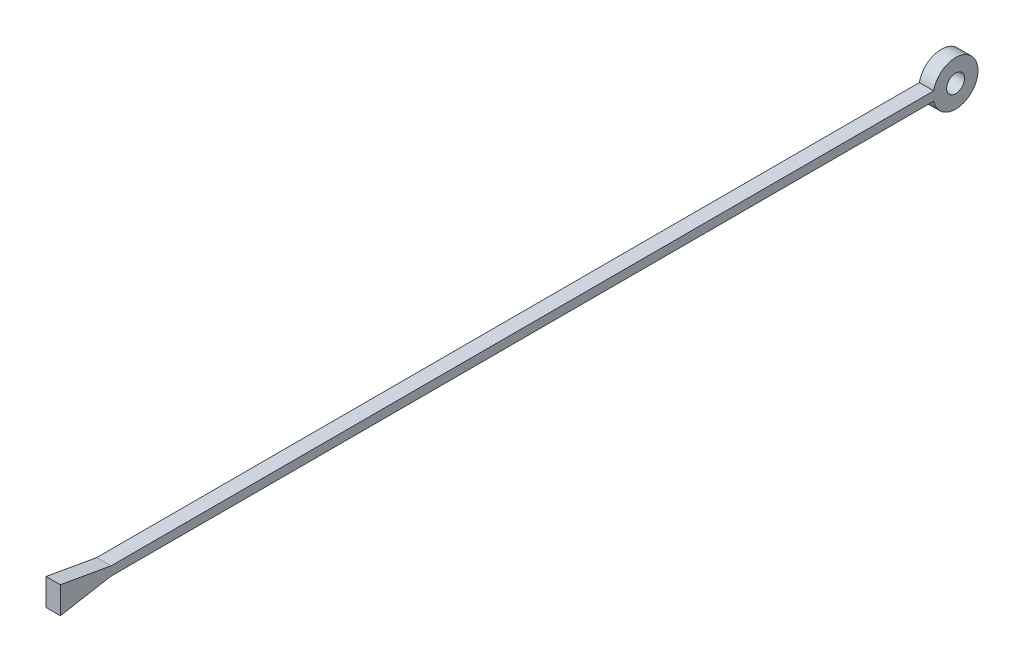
ISO-10303-21;
HEADER;
FILE_DESCRIPTION(('STEP AP214'),'2;1');
FILE_NAME('part.step','',(''),(''),'','','');
FILE_SCHEMA(('AUTOMOTIVE_DESIGN { 1 0 10303 214 1 1 1 1 }'));
ENDSEC;
DATA;
#1=APPLICATION_CONTEXT('core data for automotive mechanical design processes');
#2=APPLICATION_PROTOCOL_DEFINITION('international standard','automotive_design',2000,#1);
#3=PRODUCT_CONTEXT('',#1,'mechanical');
#4=PRODUCT('Part','Part','',(#3));
#5=PRODUCT_RELATED_PRODUCT_CATEGORY('part','',(#4));
#6=PRODUCT_DEFINITION_FORMATION('','',#4);
#7=PRODUCT_DEFINITION_CONTEXT('part definition',#1,'design');
#8=PRODUCT_DEFINITION('design','',#6,#7);
#9=PRODUCT_DEFINITION_SHAPE('','',#8);
#10=(LENGTH_UNIT() NAMED_UNIT(*) SI_UNIT(.MILLI.,.METRE.));
#11=(NAMED_UNIT(*) PLANE_ANGLE_UNIT() SI_UNIT($,.RADIAN.));
#12=(NAMED_UNIT(*) SI_UNIT($,.STERADIAN.) SOLID_ANGLE_UNIT());
#13=UNCERTAINTY_MEASURE_WITH_UNIT(LENGTH_MEASURE(1.E-05),#10,'distance_accuracy_value','');
#14=(GEOMETRIC_REPRESENTATION_CONTEXT(3) GLOBAL_UNCERTAINTY_ASSIGNED_CONTEXT((#13)) GLOBAL_UNIT_ASSIGNED_CONTEXT((#10,
#11,#12)) REPRESENTATION_CONTEXT('',''));
#15=CARTESIAN_POINT('',(0.,0.,0.));
#16=DIRECTION('',(0.,0.,1.));
#17=DIRECTION('',(1.,0.,0.));
#18=AXIS2_PLACEMENT_3D('',#15,#16,#17);
#19=CARTESIAN_POINT('',(8.,0.,0.));
#20=DIRECTION('',(1.,0.,0.));
#21=DIRECTION('',(0.,0.,-1.));
#22=AXIS2_PLACEMENT_3D('',#19,#20,#21);
#23=PLANE('',#22);
#24=DIRECTION('',(0.,0.173648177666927,0.984807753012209));
#25=VECTOR('',#24,1.);
#26=CARTESIAN_POINT('',(8.,2.5,471.643590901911));
#27=LINE('',#26,#25);
#28=CARTESIAN_POINT('',(8.,2.5,471.643590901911));
#29=VERTEX_POINT('',#28);
#30=CARTESIAN_POINT('',(8.,7.49999999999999,500.));
#31=VERTEX_POINT('',#30);
#32=EDGE_CURVE('E132',#29,#31,#27,.T.);
#33=ORIENTED_EDGE('',*,*,#32,.T.);
#34=DIRECTION('',(0.,-1.,0.));
#35=VECTOR('',#34,1.);
#36=CARTESIAN_POINT('',(8.,7.49999999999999,500.));
#37=LINE('',#36,#35);
#38=CARTESIAN_POINT('',(8.,-7.50000000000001,500.));
#39=VERTEX_POINT('',#38);
#40=EDGE_CURVE('E90',#31,#39,#37,.T.);
#41=ORIENTED_EDGE('',*,*,#40,.T.);
#42=DIRECTION('',(0.,0.173648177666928,-0.984807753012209));
#43=VECTOR('',#42,1.);
#44=CARTESIAN_POINT('',(8.,-2.5,471.643590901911));
#45=LINE('',#44,#43);
#46=CARTESIAN_POINT('',(8.,-2.5,471.643590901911));
#47=VERTEX_POINT('',#46);
#48=EDGE_CURVE('E103',#39,#47,#45,.T.);
#49=ORIENTED_EDGE('',*,*,#48,.T.);
#50=DIRECTION('',(0.,0.,-1.));
#51=VECTOR('',#50,1.);
#52=CARTESIAN_POINT('',(8.,-2.5,471.643590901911));
#53=LINE('',#52,#51);
#54=CARTESIAN_POINT('',(8.,-2.5,12.2474487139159));
#55=VERTEX_POINT('',#54);
#56=EDGE_CURVE('E97',#47,#55,#53,.T.);
#57=ORIENTED_EDGE('',*,*,#56,.T.);
#58=CARTESIAN_POINT('',(8.,0.,0.));
#59=DIRECTION('',(1.,0.,0.));
#60=DIRECTION('',(0.,0.,-1.));
#61=AXIS2_PLACEMENT_3D('',#58,#59,#60);
#62=CIRCLE('',#61,12.5);
#63=CARTESIAN_POINT('',(8.,2.5,12.2474487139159));
#64=VERTEX_POINT('',#63);
#65=EDGE_CURVE('E101',#55,#64,#62,.T.);
#66=ORIENTED_EDGE('',*,*,#65,.T.);
#67=DIRECTION('',(0.,0.,1.));
#68=VECTOR('',#67,1.);
#69=CARTESIAN_POINT('',(8.,2.5,471.643590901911));
#70=LINE('',#69,#68);
#71=EDGE_CURVE('E53',#64,#29,#70,.T.);
#72=ORIENTED_EDGE('',*,*,#71,.T.);
#73=EDGE_LOOP('',(#33,#41,#49,#57,#66,#72));
#74=FACE_BOUND('',#73,.T.);
#75=CARTESIAN_POINT('',(8.,0.,0.));
#76=DIRECTION('',(1.,0.,0.));
#77=DIRECTION('',(0.,0.,-1.));
#78=AXIS2_PLACEMENT_3D('',#75,#76,#77);
#79=CIRCLE('',#78,5.);
#80=CARTESIAN_POINT('',(8.,0.,-5.));
#81=VERTEX_POINT('',#80);
#82=EDGE_CURVE('E125',#81,#81,#79,.T.);
#83=ORIENTED_EDGE('',*,*,#82,.F.);
#84=EDGE_LOOP('',(#83));
#85=FACE_BOUND('',#84,.T.);
#86=ADVANCED_FACE('F36',(#74,#85),#23,.T.);
#87=CARTESIAN_POINT('',(0.,0.,0.));
#88=DIRECTION('',(1.,0.,0.));
#89=DIRECTION('',(0.,0.,-1.));
#90=AXIS2_PLACEMENT_3D('',#87,#88,#89);
#91=PLANE('',#90);
#92=DIRECTION('',(0.,0.173648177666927,0.984807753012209));
#93=VECTOR('',#92,1.);
#94=CARTESIAN_POINT('',(0.,2.5,471.643590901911));
#95=LINE('',#94,#93);
#96=CARTESIAN_POINT('',(0.,2.5,471.643590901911));
#97=VERTEX_POINT('',#96);
#98=CARTESIAN_POINT('',(0.,7.49999999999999,500.));
#99=VERTEX_POINT('',#98);
#100=EDGE_CURVE('E121',#97,#99,#95,.T.);
#101=ORIENTED_EDGE('',*,*,#100,.F.);
#102=DIRECTION('',(0.,0.,1.));
#103=VECTOR('',#102,1.);
#104=CARTESIAN_POINT('',(0.,2.5,471.643590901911));
#105=LINE('',#104,#103);
#106=CARTESIAN_POINT('',(0.,2.5,12.2474487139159));
#107=VERTEX_POINT('',#106);
#108=EDGE_CURVE('E82',#107,#97,#105,.T.);
#109=ORIENTED_EDGE('',*,*,#108,.F.);
#110=CARTESIAN_POINT('',(0.,0.,0.));
#111=DIRECTION('',(1.,0.,0.));
#112=DIRECTION('',(0.,0.,-1.));
#113=AXIS2_PLACEMENT_3D('',#110,#111,#112);
#114=CIRCLE('',#113,12.5);
#115=CARTESIAN_POINT('',(0.,-2.5,12.2474487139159));
#116=VERTEX_POINT('',#115);
#117=EDGE_CURVE('E76',#116,#107,#114,.T.);
#118=ORIENTED_EDGE('',*,*,#117,.F.);
#119=DIRECTION('',(0.,0.,-1.));
#120=VECTOR('',#119,1.);
#121=CARTESIAN_POINT('',(0.,-2.5,471.643590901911));
#122=LINE('',#121,#120);
#123=CARTESIAN_POINT('',(0.,-2.5,471.643590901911));
#124=VERTEX_POINT('',#123);
#125=EDGE_CURVE('E111',#124,#116,#122,.T.);
#126=ORIENTED_EDGE('',*,*,#125,.F.);
#127=DIRECTION('',(0.,0.173648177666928,-0.984807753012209));
#128=VECTOR('',#127,1.);
#129=CARTESIAN_POINT('',(0.,-2.5,471.643590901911));
#130=LINE('',#129,#128);
#131=CARTESIAN_POINT('',(0.,-7.50000000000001,500.));
#132=VERTEX_POINT('',#131);
#133=EDGE_CURVE('E127',#132,#124,#130,.T.);
#134=ORIENTED_EDGE('',*,*,#133,.F.);
#135=DIRECTION('',(0.,-1.,0.));
#136=VECTOR('',#135,1.);
#137=CARTESIAN_POINT('',(0.,7.49999999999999,500.));
#138=LINE('',#137,#136);
#139=EDGE_CURVE('E124',#99,#132,#138,.T.);
#140=ORIENTED_EDGE('',*,*,#139,.F.);
#141=EDGE_LOOP('',(#101,#109,#118,#126,#134,#140));
#142=FACE_BOUND('',#141,.T.);
#143=CARTESIAN_POINT('',(0.,0.,0.));
#144=DIRECTION('',(1.,0.,0.));
#145=DIRECTION('',(0.,0.,-1.));
#146=AXIS2_PLACEMENT_3D('',#143,#144,#145);
#147=CIRCLE('',#146,5.);
#148=CARTESIAN_POINT('',(0.,0.,-5.));
#149=VERTEX_POINT('',#148);
#150=EDGE_CURVE('E225',#149,#149,#147,.T.);
#151=ORIENTED_EDGE('',*,*,#150,.T.);
#152=EDGE_LOOP('',(#151));
#153=FACE_BOUND('',#152,.T.);
#154=ADVANCED_FACE('F141',(#142,#153),#91,.F.);
#155=CARTESIAN_POINT('',(8.,2.5,471.643590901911));
#156=DIRECTION('',(0.,-0.984807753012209,0.173648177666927));
#157=DIRECTION('',(0.,-0.173648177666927,-0.984807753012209));
#158=AXIS2_PLACEMENT_3D('',#155,#156,#157);
#159=PLANE('',#158);
#160=ORIENTED_EDGE('',*,*,#100,.T.);
#161=DIRECTION('',(-1.,0.,0.));
#162=VECTOR('',#161,1.);
#163=CARTESIAN_POINT('',(8.,7.49999999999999,500.));
#164=LINE('',#163,#162);
#165=EDGE_CURVE('E11',#31,#99,#164,.T.);
#166=ORIENTED_EDGE('',*,*,#165,.F.);
#167=ORIENTED_EDGE('',*,*,#32,.F.);
#168=DIRECTION('',(-1.,0.,0.));
#169=VECTOR('',#168,1.);
#170=CARTESIAN_POINT('',(8.,2.5,471.643590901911));
#171=LINE('',#170,#169);
#172=EDGE_CURVE('E117',#29,#97,#171,.T.);
#173=ORIENTED_EDGE('',*,*,#172,.T.);
#174=EDGE_LOOP('',(#160,#166,#167,#173));
#175=FACE_BOUND('',#174,.T.);
#176=ADVANCED_FACE('F38',(#175),#159,.F.);
#177=CARTESIAN_POINT('',(8.,7.49999999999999,500.));
#178=DIRECTION('',(0.,0.,-1.));
#179=DIRECTION('',(-1.,0.,0.));
#180=AXIS2_PLACEMENT_3D('',#177,#178,#179);
#181=PLANE('',#180);
#182=ORIENTED_EDGE('',*,*,#139,.T.);
#183=DIRECTION('',(-1.,0.,0.));
#184=VECTOR('',#183,1.);
#185=CARTESIAN_POINT('',(8.,-7.50000000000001,500.));
#186=LINE('',#185,#184);
#187=EDGE_CURVE('E45',#39,#132,#186,.T.);
#188=ORIENTED_EDGE('',*,*,#187,.F.);
#189=ORIENTED_EDGE('',*,*,#40,.F.);
#190=ORIENTED_EDGE('',*,*,#165,.T.);
#191=EDGE_LOOP('',(#182,#188,#189,#190));
#192=FACE_BOUND('',#191,.T.);
#193=ADVANCED_FACE('F166',(#192),#181,.F.);
#194=CARTESIAN_POINT('',(8.,-2.5,471.643590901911));
#195=DIRECTION('',(0.,0.984807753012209,0.173648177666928));
#196=DIRECTION('',(0.,-0.173648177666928,0.984807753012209));
#197=AXIS2_PLACEMENT_3D('',#194,#195,#196);
#198=PLANE('',#197);
#199=ORIENTED_EDGE('',*,*,#133,.T.);
#200=DIRECTION('',(-1.,0.,0.));
#201=VECTOR('',#200,1.);
#202=CARTESIAN_POINT('',(8.,-2.5,471.643590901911));
#203=LINE('',#202,#201);
#204=EDGE_CURVE('E112',#47,#124,#203,.T.);
#205=ORIENTED_EDGE('',*,*,#204,.F.);
#206=ORIENTED_EDGE('',*,*,#48,.F.);
#207=ORIENTED_EDGE('',*,*,#187,.T.);
#208=EDGE_LOOP('',(#199,#205,#206,#207));
#209=FACE_BOUND('',#208,.T.);
#210=ADVANCED_FACE('F138',(#209),#198,.F.);
#211=CARTESIAN_POINT('',(8.,-2.5,471.643590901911));
#212=DIRECTION('',(0.,1.,0.));
#213=DIRECTION('',(0.,0.,1.));
#214=AXIS2_PLACEMENT_3D('',#211,#212,#213);
#215=PLANE('',#214);
#216=ORIENTED_EDGE('',*,*,#125,.T.);
#217=DIRECTION('',(-1.,0.,0.));
#218=VECTOR('',#217,1.);
#219=CARTESIAN_POINT('',(8.,-2.5,12.2474487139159));
#220=LINE('',#219,#218);
#221=EDGE_CURVE('E108',#55,#116,#220,.T.);
#222=ORIENTED_EDGE('',*,*,#221,.F.);
#223=ORIENTED_EDGE('',*,*,#56,.F.);
#224=ORIENTED_EDGE('',*,*,#204,.T.);
#225=EDGE_LOOP('',(#216,#222,#223,#224));
#226=FACE_BOUND('',#225,.T.);
#227=ADVANCED_FACE('F109',(#226),#215,.F.);
#228=CARTESIAN_POINT('',(8.,0.,0.));
#229=DIRECTION('',(-1.,0.,0.));
#230=DIRECTION('',(0.,0.,1.));
#231=AXIS2_PLACEMENT_3D('',#228,#229,#230);
#232=CYLINDRICAL_SURFACE('',#231,12.5);
#233=ORIENTED_EDGE('',*,*,#117,.T.);
#234=DIRECTION('',(-1.,0.,0.));
#235=VECTOR('',#234,1.);
#236=CARTESIAN_POINT('',(8.,2.5,12.2474487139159));
#237=LINE('',#236,#235);
#238=EDGE_CURVE('E113',#64,#107,#237,.T.);
#239=ORIENTED_EDGE('',*,*,#238,.F.);
#240=ORIENTED_EDGE('',*,*,#65,.F.);
#241=ORIENTED_EDGE('',*,*,#221,.T.);
#242=EDGE_LOOP('',(#233,#239,#240,#241));
#243=FACE_BOUND('',#242,.T.);
#244=ADVANCED_FACE('F115',(#243),#232,.T.);
#245=CARTESIAN_POINT('',(8.,2.5,471.643590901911));
#246=DIRECTION('',(0.,-1.,0.));
#247=DIRECTION('',(0.,0.,-1.));
#248=AXIS2_PLACEMENT_3D('',#245,#246,#247);
#249=PLANE('',#248);
#250=ORIENTED_EDGE('',*,*,#108,.T.);
#251=ORIENTED_EDGE('',*,*,#172,.F.);
#252=ORIENTED_EDGE('',*,*,#71,.F.);
#253=ORIENTED_EDGE('',*,*,#238,.T.);
#254=EDGE_LOOP('',(#250,#251,#252,#253));
#255=FACE_BOUND('',#254,.T.);
#256=ADVANCED_FACE('F146',(#255),#249,.F.);
#257=CARTESIAN_POINT('',(8.,0.,0.));
#258=DIRECTION('',(-1.,0.,0.));
#259=DIRECTION('',(0.,0.,1.));
#260=AXIS2_PLACEMENT_3D('',#257,#258,#259);
#261=CYLINDRICAL_SURFACE('',#260,5.);
#262=ORIENTED_EDGE('',*,*,#82,.T.);
#263=EDGE_LOOP('',(#262));
#264=FACE_BOUND('',#263,.T.);
#265=ORIENTED_EDGE('',*,*,#150,.F.);
#266=EDGE_LOOP('',(#265));
#267=FACE_BOUND('',#266,.T.);
#268=ADVANCED_FACE('F148',(#264,#267),#261,.F.);
#269=CLOSED_SHELL('',(#86,#154,#176,#193,#210,#227,#244,#256,#268));
#270=MANIFOLD_SOLID_BREP('B2',#269);
#271=ADVANCED_BREP_SHAPE_REPRESENTATION('',(#18,#270),#14);
#272=SHAPE_DEFINITION_REPRESENTATION(#9,#271);
ENDSEC;
END-ISO-10303-21;
